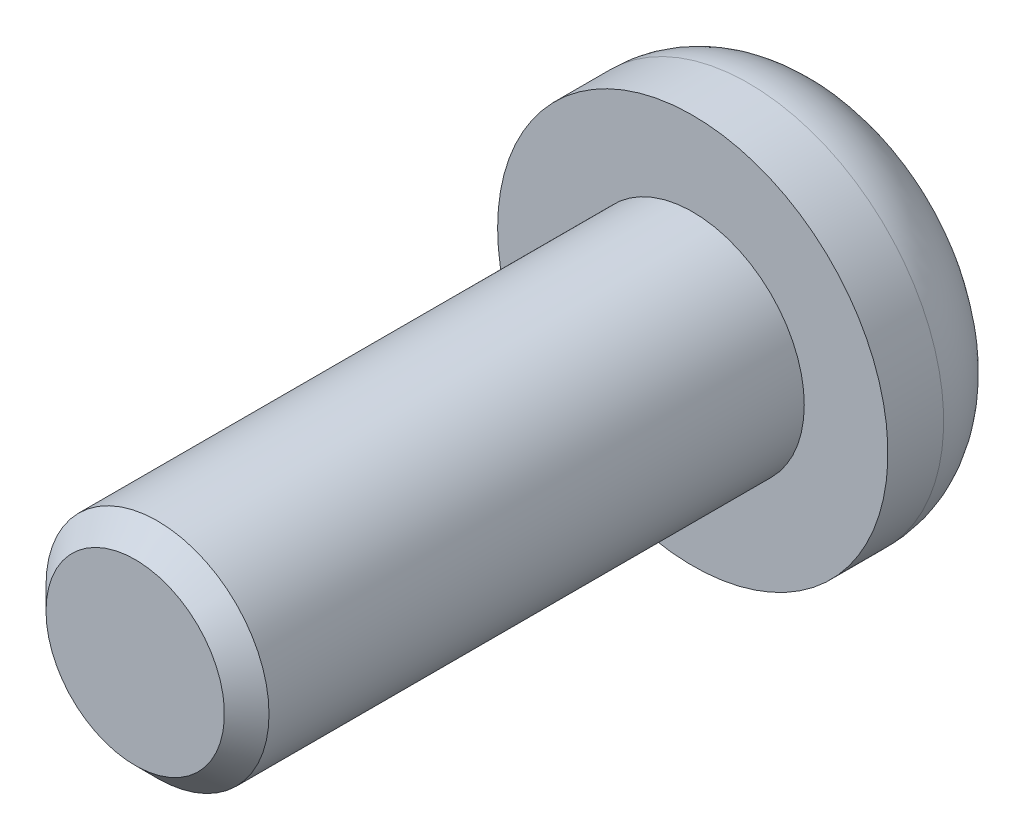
ISO-10303-21;
HEADER;
FILE_DESCRIPTION(('STEP AP214'),'2;1');
FILE_NAME('part.step','',(''),(''),'','','');
FILE_SCHEMA(('AUTOMOTIVE_DESIGN { 1 0 10303 214 1 1 1 1 }'));
ENDSEC;
DATA;
#1=APPLICATION_CONTEXT('core data for automotive mechanical design processes');
#2=APPLICATION_PROTOCOL_DEFINITION('international standard','automotive_design',2000,#1);
#3=PRODUCT_CONTEXT('',#1,'mechanical');
#4=PRODUCT('Part','Part','',(#3));
#5=PRODUCT_RELATED_PRODUCT_CATEGORY('part','',(#4));
#6=PRODUCT_DEFINITION_FORMATION('','',#4);
#7=PRODUCT_DEFINITION_CONTEXT('part definition',#1,'design');
#8=PRODUCT_DEFINITION('design','',#6,#7);
#9=PRODUCT_DEFINITION_SHAPE('','',#8);
#10=(LENGTH_UNIT() NAMED_UNIT(*) SI_UNIT(.MILLI.,.METRE.));
#11=(NAMED_UNIT(*) PLANE_ANGLE_UNIT() SI_UNIT($,.RADIAN.));
#12=(NAMED_UNIT(*) SI_UNIT($,.STERADIAN.) SOLID_ANGLE_UNIT());
#13=UNCERTAINTY_MEASURE_WITH_UNIT(LENGTH_MEASURE(1.E-05),#10,'distance_accuracy_value','');
#14=(GEOMETRIC_REPRESENTATION_CONTEXT(3) GLOBAL_UNCERTAINTY_ASSIGNED_CONTEXT((#13)) GLOBAL_UNIT_ASSIGNED_CONTEXT((#10,
#11,#12)) REPRESENTATION_CONTEXT('',''));
#15=CARTESIAN_POINT('',(0.,0.,0.));
#16=DIRECTION('',(0.,0.,1.));
#17=DIRECTION('',(1.,0.,0.));
#18=AXIS2_PLACEMENT_3D('',#15,#16,#17);
#19=CARTESIAN_POINT('',(0.,0.,-2.5));
#20=DIRECTION('',(0.,0.,1.));
#21=DIRECTION('',(1.,0.,0.));
#22=AXIS2_PLACEMENT_3D('',#19,#20,#21);
#23=PLANE('',#22);
#24=CARTESIAN_POINT('',(0.,0.,-2.5));
#25=DIRECTION('',(0.,0.,-1.));
#26=DIRECTION('',(-1.,0.,0.));
#27=AXIS2_PLACEMENT_3D('',#24,#25,#26);
#28=CIRCLE('',#27,2.);
#29=CARTESIAN_POINT('',(-2.,0.,-2.5));
#30=VERTEX_POINT('',#29);
#31=EDGE_CURVE('E88',#30,#30,#28,.T.);
#32=ORIENTED_EDGE('',*,*,#31,.T.);
#33=EDGE_LOOP('',(#32));
#34=FACE_BOUND('',#33,.T.);
#35=DIRECTION('',(-0.86602540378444,0.499999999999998,0.));
#36=VECTOR('',#35,1.);
#37=CARTESIAN_POINT('',(0.,1.73205080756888,-2.5));
#38=LINE('',#37,#36);
#39=CARTESIAN_POINT('',(1.5,0.866025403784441,-2.5));
#40=VERTEX_POINT('',#39);
#41=CARTESIAN_POINT('',(0.,1.73205080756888,-2.5));
#42=VERTEX_POINT('',#41);
#43=EDGE_CURVE('E45',#40,#42,#38,.T.);
#44=ORIENTED_EDGE('',*,*,#43,.T.);
#45=DIRECTION('',(-0.866025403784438,-0.500000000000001,0.));
#46=VECTOR('',#45,1.);
#47=CARTESIAN_POINT('',(0.,1.73205080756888,-2.5));
#48=LINE('',#47,#46);
#49=CARTESIAN_POINT('',(-1.5,0.866025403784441,-2.5));
#50=VERTEX_POINT('',#49);
#51=EDGE_CURVE('E146',#42,#50,#48,.T.);
#52=ORIENTED_EDGE('',*,*,#51,.T.);
#53=DIRECTION('',(0.,-1.,0.));
#54=VECTOR('',#53,1.);
#55=CARTESIAN_POINT('',(-1.5,-0.866025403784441,-2.5));
#56=LINE('',#55,#54);
#57=CARTESIAN_POINT('',(-1.5,-0.866025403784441,-2.5));
#58=VERTEX_POINT('',#57);
#59=EDGE_CURVE('E149',#50,#58,#56,.T.);
#60=ORIENTED_EDGE('',*,*,#59,.T.);
#61=DIRECTION('',(0.866025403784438,-0.500000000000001,0.));
#62=VECTOR('',#61,1.);
#63=CARTESIAN_POINT('',(0.,-1.73205080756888,-2.5));
#64=LINE('',#63,#62);
#65=CARTESIAN_POINT('',(0.,-1.73205080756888,-2.5));
#66=VERTEX_POINT('',#65);
#67=EDGE_CURVE('E155',#58,#66,#64,.T.);
#68=ORIENTED_EDGE('',*,*,#67,.T.);
#69=DIRECTION('',(0.86602540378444,0.499999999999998,0.));
#70=VECTOR('',#69,1.);
#71=CARTESIAN_POINT('',(0.,-1.73205080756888,-2.5));
#72=LINE('',#71,#70);
#73=CARTESIAN_POINT('',(1.5,-0.866025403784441,-2.5));
#74=VERTEX_POINT('',#73);
#75=EDGE_CURVE('E158',#66,#74,#72,.T.);
#76=ORIENTED_EDGE('',*,*,#75,.T.);
#77=DIRECTION('',(0.,1.,0.));
#78=VECTOR('',#77,1.);
#79=CARTESIAN_POINT('',(1.5,-0.866025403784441,-2.5));
#80=LINE('',#79,#78);
#81=EDGE_CURVE('E94',#74,#40,#80,.T.);
#82=ORIENTED_EDGE('',*,*,#81,.T.);
#83=EDGE_LOOP('',(#44,#52,#60,#68,#76,#82));
#84=FACE_BOUND('',#83,.T.);
#85=ADVANCED_FACE('F31',(#34,#84),#23,.F.);
#86=CARTESIAN_POINT('',(0.,0.,0.));
#87=DIRECTION('',(0.,0.,-1.));
#88=DIRECTION('',(-1.,0.,0.));
#89=AXIS2_PLACEMENT_3D('',#86,#87,#88);
#90=PLANE('',#89);
#91=CARTESIAN_POINT('',(0.,0.,0.));
#92=DIRECTION('',(0.,0.,1.));
#93=DIRECTION('',(1.,0.,0.));
#94=AXIS2_PLACEMENT_3D('',#91,#92,#93);
#95=CIRCLE('',#94,2.);
#96=CARTESIAN_POINT('',(2.,0.,0.));
#97=VERTEX_POINT('',#96);
#98=EDGE_CURVE('E147',#97,#97,#95,.T.);
#99=ORIENTED_EDGE('',*,*,#98,.F.);
#100=EDGE_LOOP('',(#99));
#101=FACE_BOUND('',#100,.T.);
#102=CARTESIAN_POINT('',(0.,0.,0.));
#103=DIRECTION('',(0.,0.,-1.));
#104=DIRECTION('',(-1.,0.,0.));
#105=AXIS2_PLACEMENT_3D('',#102,#103,#104);
#106=CIRCLE('',#105,3.5);
#107=CARTESIAN_POINT('',(-3.5,0.,0.));
#108=VERTEX_POINT('',#107);
#109=EDGE_CURVE('E169',#108,#108,#106,.T.);
#110=ORIENTED_EDGE('',*,*,#109,.F.);
#111=EDGE_LOOP('',(#110));
#112=FACE_BOUND('',#111,.T.);
#113=ADVANCED_FACE('F132',(#101,#112),#90,.F.);
#114=CARTESIAN_POINT('',(0.,0.,-1.));
#115=DIRECTION('',(0.,0.,-1.));
#116=DIRECTION('',(-1.,0.,0.));
#117=AXIS2_PLACEMENT_3D('',#114,#115,#116);
#118=TOROIDAL_SURFACE('',#117,2.,1.5);
#119=ORIENTED_EDGE('',*,*,#31,.F.);
#120=EDGE_LOOP('',(#119));
#121=FACE_BOUND('',#120,.T.);
#122=CARTESIAN_POINT('',(0.,0.,-1.));
#123=DIRECTION('',(0.,0.,-1.));
#124=DIRECTION('',(-1.,0.,0.));
#125=AXIS2_PLACEMENT_3D('',#122,#123,#124);
#126=CIRCLE('',#125,3.5);
#127=CARTESIAN_POINT('',(-3.5,0.,-1.));
#128=VERTEX_POINT('',#127);
#129=EDGE_CURVE('E172',#128,#128,#126,.T.);
#130=ORIENTED_EDGE('',*,*,#129,.T.);
#131=EDGE_LOOP('',(#130));
#132=FACE_BOUND('',#131,.T.);
#133=ADVANCED_FACE('F137',(#121,#132),#118,.T.);
#134=CARTESIAN_POINT('',(0.,0.,0.));
#135=DIRECTION('',(0.,0.,-1.));
#136=DIRECTION('',(-1.,0.,0.));
#137=AXIS2_PLACEMENT_3D('',#134,#135,#136);
#138=CYLINDRICAL_SURFACE('',#137,3.5);
#139=ORIENTED_EDGE('',*,*,#129,.F.);
#140=EDGE_LOOP('',(#139));
#141=FACE_BOUND('',#140,.T.);
#142=ORIENTED_EDGE('',*,*,#109,.T.);
#143=EDGE_LOOP('',(#142));
#144=FACE_BOUND('',#143,.T.);
#145=ADVANCED_FACE('F177',(#141,#144),#138,.T.);
#146=CARTESIAN_POINT('',(0.,1.73205080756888,2.5));
#147=DIRECTION('',(-0.499999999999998,-0.86602540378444,0.));
#148=DIRECTION('',(0.86602540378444,-0.499999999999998,0.));
#149=AXIS2_PLACEMENT_3D('',#146,#147,#148);
#150=PLANE('',#149);
#151=DIRECTION('',(-0.86602540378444,0.499999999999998,0.));
#152=VECTOR('',#151,1.);
#153=CARTESIAN_POINT('',(0.749999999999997,1.29903810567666,0.));
#154=LINE('',#153,#152);
#155=CARTESIAN_POINT('',(1.5,0.866025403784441,0.));
#156=VERTEX_POINT('',#155);
#157=CARTESIAN_POINT('',(0.,1.73205080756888,0.));
#158=VERTEX_POINT('',#157);
#159=EDGE_CURVE('E53',#156,#158,#154,.T.);
#160=ORIENTED_EDGE('',*,*,#159,.T.);
#161=DIRECTION('',(0.,0.,-1.));
#162=VECTOR('',#161,1.);
#163=CARTESIAN_POINT('',(0.,1.73205080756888,2.5));
#164=LINE('',#163,#162);
#165=EDGE_CURVE('E167',#158,#42,#164,.T.);
#166=ORIENTED_EDGE('',*,*,#165,.T.);
#167=ORIENTED_EDGE('',*,*,#43,.F.);
#168=DIRECTION('',(0.,0.,-1.));
#169=VECTOR('',#168,1.);
#170=CARTESIAN_POINT('',(1.5,0.866025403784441,2.5));
#171=LINE('',#170,#169);
#172=EDGE_CURVE('E99',#156,#40,#171,.T.);
#173=ORIENTED_EDGE('',*,*,#172,.F.);
#174=EDGE_LOOP('',(#160,#166,#167,#173));
#175=FACE_BOUND('',#174,.T.);
#176=ADVANCED_FACE('F180',(#175),#150,.T.);
#177=CARTESIAN_POINT('',(0.,1.73205080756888,2.5));
#178=DIRECTION('',(0.500000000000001,-0.866025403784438,0.));
#179=DIRECTION('',(0.866025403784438,0.500000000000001,0.));
#180=AXIS2_PLACEMENT_3D('',#177,#178,#179);
#181=PLANE('',#180);
#182=DIRECTION('',(-0.866025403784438,-0.500000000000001,0.));
#183=VECTOR('',#182,1.);
#184=CARTESIAN_POINT('',(-0.750000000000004,1.29903810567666,0.));
#185=LINE('',#184,#183);
#186=CARTESIAN_POINT('',(-1.5,0.866025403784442,0.));
#187=VERTEX_POINT('',#186);
#188=EDGE_CURVE('E111',#158,#187,#185,.T.);
#189=ORIENTED_EDGE('',*,*,#188,.T.);
#190=DIRECTION('',(0.,0.,-1.));
#191=VECTOR('',#190,1.);
#192=CARTESIAN_POINT('',(-1.5,0.866025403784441,2.5));
#193=LINE('',#192,#191);
#194=EDGE_CURVE('E165',#187,#50,#193,.T.);
#195=ORIENTED_EDGE('',*,*,#194,.T.);
#196=ORIENTED_EDGE('',*,*,#51,.F.);
#197=ORIENTED_EDGE('',*,*,#165,.F.);
#198=EDGE_LOOP('',(#189,#195,#196,#197));
#199=FACE_BOUND('',#198,.T.);
#200=ADVANCED_FACE('F188',(#199),#181,.T.);
#201=CARTESIAN_POINT('',(-1.5,-0.866025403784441,2.5));
#202=DIRECTION('',(1.,0.,0.));
#203=DIRECTION('',(0.,0.,-1.));
#204=AXIS2_PLACEMENT_3D('',#201,#202,#203);
#205=PLANE('',#204);
#206=DIRECTION('',(0.,-1.,0.));
#207=VECTOR('',#206,1.);
#208=CARTESIAN_POINT('',(-1.5,0.,0.));
#209=LINE('',#208,#207);
#210=CARTESIAN_POINT('',(-1.5,-0.866025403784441,0.));
#211=VERTEX_POINT('',#210);
#212=EDGE_CURVE('E105',#187,#211,#209,.T.);
#213=ORIENTED_EDGE('',*,*,#212,.T.);
#214=DIRECTION('',(0.,0.,-1.));
#215=VECTOR('',#214,1.);
#216=CARTESIAN_POINT('',(-1.5,-0.866025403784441,2.5));
#217=LINE('',#216,#215);
#218=EDGE_CURVE('E163',#211,#58,#217,.T.);
#219=ORIENTED_EDGE('',*,*,#218,.T.);
#220=ORIENTED_EDGE('',*,*,#59,.F.);
#221=ORIENTED_EDGE('',*,*,#194,.F.);
#222=EDGE_LOOP('',(#213,#219,#220,#221));
#223=FACE_BOUND('',#222,.T.);
#224=ADVANCED_FACE('F194',(#223),#205,.T.);
#225=CARTESIAN_POINT('',(0.,-1.73205080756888,2.5));
#226=DIRECTION('',(0.500000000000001,0.866025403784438,0.));
#227=DIRECTION('',(-0.866025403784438,0.500000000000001,0.));
#228=AXIS2_PLACEMENT_3D('',#225,#226,#227);
#229=PLANE('',#228);
#230=DIRECTION('',(0.866025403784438,-0.500000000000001,0.));
#231=VECTOR('',#230,1.);
#232=CARTESIAN_POINT('',(-0.750000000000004,-1.29903810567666,0.));
#233=LINE('',#232,#231);
#234=CARTESIAN_POINT('',(0.,-1.73205080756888,0.));
#235=VERTEX_POINT('',#234);
#236=EDGE_CURVE('E103',#211,#235,#233,.T.);
#237=ORIENTED_EDGE('',*,*,#236,.T.);
#238=DIRECTION('',(0.,0.,-1.));
#239=VECTOR('',#238,1.);
#240=CARTESIAN_POINT('',(0.,-1.73205080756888,2.5));
#241=LINE('',#240,#239);
#242=EDGE_CURVE('E98',#235,#66,#241,.T.);
#243=ORIENTED_EDGE('',*,*,#242,.T.);
#244=ORIENTED_EDGE('',*,*,#67,.F.);
#245=ORIENTED_EDGE('',*,*,#218,.F.);
#246=EDGE_LOOP('',(#237,#243,#244,#245));
#247=FACE_BOUND('',#246,.T.);
#248=ADVANCED_FACE('F198',(#247),#229,.T.);
#249=CARTESIAN_POINT('',(0.,-1.73205080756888,2.5));
#250=DIRECTION('',(-0.499999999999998,0.86602540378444,0.));
#251=DIRECTION('',(-0.86602540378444,-0.499999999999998,0.));
#252=AXIS2_PLACEMENT_3D('',#249,#250,#251);
#253=PLANE('',#252);
#254=DIRECTION('',(0.86602540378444,0.499999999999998,0.));
#255=VECTOR('',#254,1.);
#256=CARTESIAN_POINT('',(0.749999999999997,-1.29903810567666,0.));
#257=LINE('',#256,#255);
#258=CARTESIAN_POINT('',(1.5,-0.866025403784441,0.));
#259=VERTEX_POINT('',#258);
#260=EDGE_CURVE('E85',#235,#259,#257,.T.);
#261=ORIENTED_EDGE('',*,*,#260,.T.);
#262=DIRECTION('',(0.,0.,-1.));
#263=VECTOR('',#262,1.);
#264=CARTESIAN_POINT('',(1.5,-0.866025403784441,2.5));
#265=LINE('',#264,#263);
#266=EDGE_CURVE('E91',#259,#74,#265,.T.);
#267=ORIENTED_EDGE('',*,*,#266,.T.);
#268=ORIENTED_EDGE('',*,*,#75,.F.);
#269=ORIENTED_EDGE('',*,*,#242,.F.);
#270=EDGE_LOOP('',(#261,#267,#268,#269));
#271=FACE_BOUND('',#270,.T.);
#272=ADVANCED_FACE('F102',(#271),#253,.T.);
#273=CARTESIAN_POINT('',(1.5,-0.866025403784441,2.5));
#274=DIRECTION('',(-1.,0.,0.));
#275=DIRECTION('',(0.,0.,1.));
#276=AXIS2_PLACEMENT_3D('',#273,#274,#275);
#277=PLANE('',#276);
#278=DIRECTION('',(0.,1.,0.));
#279=VECTOR('',#278,1.);
#280=CARTESIAN_POINT('',(1.5,0.,0.));
#281=LINE('',#280,#279);
#282=EDGE_CURVE('E81',#259,#156,#281,.T.);
#283=ORIENTED_EDGE('',*,*,#282,.T.);
#284=ORIENTED_EDGE('',*,*,#172,.T.);
#285=ORIENTED_EDGE('',*,*,#81,.F.);
#286=ORIENTED_EDGE('',*,*,#266,.F.);
#287=EDGE_LOOP('',(#283,#284,#285,#286));
#288=FACE_BOUND('',#287,.T.);
#289=ADVANCED_FACE('F92',(#288),#277,.T.);
#290=CARTESIAN_POINT('',(0.,0.,0.));
#291=DIRECTION('',(0.,0.,-1.));
#292=DIRECTION('',(-1.,0.,0.));
#293=AXIS2_PLACEMENT_3D('',#290,#291,#292);
#294=PLANE('',#293);
#295=ORIENTED_EDGE('',*,*,#188,.F.);
#296=ORIENTED_EDGE('',*,*,#159,.F.);
#297=ORIENTED_EDGE('',*,*,#282,.F.);
#298=ORIENTED_EDGE('',*,*,#260,.F.);
#299=ORIENTED_EDGE('',*,*,#236,.F.);
#300=ORIENTED_EDGE('',*,*,#212,.F.);
#301=EDGE_LOOP('',(#295,#296,#297,#298,#299,#300));
#302=FACE_BOUND('',#301,.T.);
#303=ADVANCED_FACE('F83',(#302),#294,.T.);
#304=CARTESIAN_POINT('',(0.,0.,10.));
#305=DIRECTION('',(0.,0.,1.));
#306=DIRECTION('',(1.,0.,0.));
#307=AXIS2_PLACEMENT_3D('',#304,#305,#306);
#308=PLANE('',#307);
#309=CARTESIAN_POINT('',(0.,0.,10.));
#310=DIRECTION('',(0.,0.,1.));
#311=DIRECTION('',(1.,0.,0.));
#312=AXIS2_PLACEMENT_3D('',#309,#310,#311);
#313=CIRCLE('',#312,1.6);
#314=CARTESIAN_POINT('',(-1.6,0.,10.));
#315=VERTEX_POINT('',#314);
#316=EDGE_CURVE('E38',#315,#315,#313,.T.);
#317=ORIENTED_EDGE('',*,*,#316,.T.);
#318=EDGE_LOOP('',(#317));
#319=FACE_BOUND('',#318,.T.);
#320=ADVANCED_FACE('F117',(#319),#308,.T.);
#321=CARTESIAN_POINT('',(0.,0.,0.));
#322=DIRECTION('',(0.,0.,1.));
#323=DIRECTION('',(1.,0.,0.));
#324=AXIS2_PLACEMENT_3D('',#321,#322,#323);
#325=CYLINDRICAL_SURFACE('',#324,2.);
#326=CARTESIAN_POINT('',(0.,0.,9.6));
#327=DIRECTION('',(0.,0.,1.));
#328=DIRECTION('',(1.,0.,0.));
#329=AXIS2_PLACEMENT_3D('',#326,#327,#328);
#330=CIRCLE('',#329,2.);
#331=CARTESIAN_POINT('',(-2.,0.,9.6));
#332=VERTEX_POINT('',#331);
#333=EDGE_CURVE('E11',#332,#332,#330,.F.);
#334=ORIENTED_EDGE('',*,*,#333,.T.);
#335=EDGE_LOOP('',(#334));
#336=FACE_BOUND('',#335,.T.);
#337=ORIENTED_EDGE('',*,*,#98,.T.);
#338=EDGE_LOOP('',(#337));
#339=FACE_BOUND('',#338,.T.);
#340=ADVANCED_FACE('F121',(#336,#339),#325,.T.);
#341=CARTESIAN_POINT('',(0.,0.,10.));
#342=DIRECTION('',(0.,0.,-1.));
#343=DIRECTION('',(-1.,0.,0.));
#344=AXIS2_PLACEMENT_3D('',#341,#342,#343);
#345=CONICAL_SURFACE('',#344,1.6,0.785398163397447);
#346=CARTESIAN_POINT('',(-2.,0.,9.6));
#347=CARTESIAN_POINT('',(-1.99583333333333,0.,9.60416666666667));
#348=CARTESIAN_POINT('',(-1.99166666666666,0.,9.60833333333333));
#349=CARTESIAN_POINT('',(-1.98333333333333,0.,9.61666666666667));
#350=CARTESIAN_POINT('',(-1.97916666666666,0.,9.62083333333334));
#351=CARTESIAN_POINT('',(-1.97083333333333,0.,9.62916666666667));
#352=CARTESIAN_POINT('',(-1.96666666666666,0.,9.63333333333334));
#353=CARTESIAN_POINT('',(-1.95833333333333,0.,9.64166666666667));
#354=CARTESIAN_POINT('',(-1.95416666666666,0.,9.64583333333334));
#355=CARTESIAN_POINT('',(-1.94583333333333,0.,9.65416666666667));
#356=CARTESIAN_POINT('',(-1.94166666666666,0.,9.65833333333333));
#357=CARTESIAN_POINT('',(-1.93333333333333,0.,9.66666666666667));
#358=CARTESIAN_POINT('',(-1.92916666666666,0.,9.67083333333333));
#359=CARTESIAN_POINT('',(-1.92083333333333,0.,9.67916666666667));
#360=CARTESIAN_POINT('',(-1.91666666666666,0.,9.68333333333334));
#361=CARTESIAN_POINT('',(-1.90833333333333,0.,9.69166666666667));
#362=CARTESIAN_POINT('',(-1.90416666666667,0.,9.69583333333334));
#363=CARTESIAN_POINT('',(-1.89583333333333,0.,9.70416666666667));
#364=CARTESIAN_POINT('',(-1.89166666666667,0.,9.70833333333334));
#365=CARTESIAN_POINT('',(-1.88333333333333,0.,9.71666666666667));
#366=CARTESIAN_POINT('',(-1.87916666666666,0.,9.72083333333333));
#367=CARTESIAN_POINT('',(-1.87083333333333,0.,9.72916666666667));
#368=CARTESIAN_POINT('',(-1.86666666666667,0.,9.73333333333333));
#369=CARTESIAN_POINT('',(-1.85833333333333,0.,9.74166666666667));
#370=CARTESIAN_POINT('',(-1.85416666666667,0.,9.74583333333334));
#371=CARTESIAN_POINT('',(-1.84583333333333,0.,9.75416666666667));
#372=CARTESIAN_POINT('',(-1.84166666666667,0.,9.75833333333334));
#373=CARTESIAN_POINT('',(-1.83333333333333,0.,9.76666666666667));
#374=CARTESIAN_POINT('',(-1.82916666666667,0.,9.77083333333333));
#375=CARTESIAN_POINT('',(-1.82083333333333,0.,9.77916666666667));
#376=CARTESIAN_POINT('',(-1.81666666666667,0.,9.78333333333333));
#377=CARTESIAN_POINT('',(-1.80833333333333,0.,9.79166666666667));
#378=CARTESIAN_POINT('',(-1.80416666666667,0.,9.79583333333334));
#379=CARTESIAN_POINT('',(-1.79583333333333,0.,9.80416666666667));
#380=CARTESIAN_POINT('',(-1.79166666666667,0.,9.80833333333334));
#381=CARTESIAN_POINT('',(-1.78333333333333,0.,9.81666666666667));
#382=CARTESIAN_POINT('',(-1.77916666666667,0.,9.82083333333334));
#383=CARTESIAN_POINT('',(-1.77083333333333,0.,9.82916666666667));
#384=CARTESIAN_POINT('',(-1.76666666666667,0.,9.83333333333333));
#385=CARTESIAN_POINT('',(-1.75833333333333,0.,9.84166666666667));
#386=CARTESIAN_POINT('',(-1.75416666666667,0.,9.84583333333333));
#387=CARTESIAN_POINT('',(-1.74583333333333,0.,9.85416666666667));
#388=CARTESIAN_POINT('',(-1.74166666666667,0.,9.85833333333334));
#389=CARTESIAN_POINT('',(-1.73333333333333,0.,9.86666666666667));
#390=CARTESIAN_POINT('',(-1.72916666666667,0.,9.87083333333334));
#391=CARTESIAN_POINT('',(-1.72083333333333,0.,9.87916666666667));
#392=CARTESIAN_POINT('',(-1.71666666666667,0.,9.88333333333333));
#393=CARTESIAN_POINT('',(-1.70833333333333,0.,9.89166666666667));
#394=CARTESIAN_POINT('',(-1.70416666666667,0.,9.89583333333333));
#395=CARTESIAN_POINT('',(-1.69583333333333,0.,9.90416666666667));
#396=CARTESIAN_POINT('',(-1.69166666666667,0.,9.90833333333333));
#397=CARTESIAN_POINT('',(-1.68333333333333,0.,9.91666666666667));
#398=CARTESIAN_POINT('',(-1.67916666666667,0.,9.92083333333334));
#399=CARTESIAN_POINT('',(-1.67083333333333,0.,9.92916666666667));
#400=CARTESIAN_POINT('',(-1.66666666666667,0.,9.93333333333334));
#401=CARTESIAN_POINT('',(-1.65833333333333,0.,9.94166666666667));
#402=CARTESIAN_POINT('',(-1.65416666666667,0.,9.94583333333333));
#403=CARTESIAN_POINT('',(-1.64583333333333,0.,9.95416666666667));
#404=CARTESIAN_POINT('',(-1.64166666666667,0.,9.95833333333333));
#405=CARTESIAN_POINT('',(-1.63333333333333,0.,9.96666666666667));
#406=CARTESIAN_POINT('',(-1.62916666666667,0.,9.97083333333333));
#407=CARTESIAN_POINT('',(-1.62083333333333,0.,9.97916666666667));
#408=CARTESIAN_POINT('',(-1.61666666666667,0.,9.98333333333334));
#409=CARTESIAN_POINT('',(-1.60833333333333,0.,9.99166666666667));
#410=CARTESIAN_POINT('',(-1.60416666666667,0.,9.99583333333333));
#411=CARTESIAN_POINT('',(-1.6,0.,10.));
#412=B_SPLINE_CURVE_WITH_KNOTS('',3,(#346,#347,#348,#349,#350,#351,#352,#353,#354,#355,#356,
#357,#358,#359,#360,#361,#362,#363,#364,#365,#366,#367,#368,#369,#370,#371,#372,#373,#374,#375,
#376,#377,#378,#379,#380,#381,#382,#383,#384,#385,#386,#387,#388,#389,#390,#391,#392,#393,#394,
#395,#396,#397,#398,#399,#400,#401,#402,#403,#404,#405,#406,#407,#408,#409,#410,#411),
.UNSPECIFIED.,.F.,.F.,(4,2,2,2,2,2,2,2,2,2,2,2,2,2,2,2,2,2,2,2,2,2,2,2,2,2,2,2,2,2,2,2,4),(0.,
0.0176776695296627,0.0353553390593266,0.0530330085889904,0.0707106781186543,0.088388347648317,
0.106066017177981,0.123743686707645,0.141421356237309,0.159099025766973,0.176776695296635,
0.194454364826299,0.212132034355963,0.229809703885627,0.24748737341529,0.265165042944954,
0.282842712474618,0.300520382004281,0.318198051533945,0.335875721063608,0.353553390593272,
0.371231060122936,0.3889087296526,0.406586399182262,0.424264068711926,0.44194173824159,
0.459619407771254,0.477297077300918,0.494974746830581,0.512652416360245,0.530330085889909,
0.548007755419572,0.565685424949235),.UNSPECIFIED.);
#413=EDGE_CURVE('BSEAM119',#332,#315,#412,.T.);
#414=ORIENTED_EDGE('',*,*,#333,.F.);
#415=ORIENTED_EDGE('',*,*,#316,.F.);
#416=ORIENTED_EDGE('',*,*,#413,.T.);
#417=ORIENTED_EDGE('',*,*,#413,.F.);
#418=EDGE_LOOP('',(#414,#416,#415,#417));
#419=FACE_BOUND('',#418,.T.);
#420=ADVANCED_FACE('F119',(#419),#345,.T.);
#421=CLOSED_SHELL('',(#85,#113,#133,#145,#176,#200,#224,#248,#272,#289,#303,#320,#340,#420));
#422=MANIFOLD_SOLID_BREP('B2',#421);
#423=ADVANCED_BREP_SHAPE_REPRESENTATION('',(#18,#422),#14);
#424=SHAPE_DEFINITION_REPRESENTATION(#9,#423);
ENDSEC;
END-ISO-10303-21;
